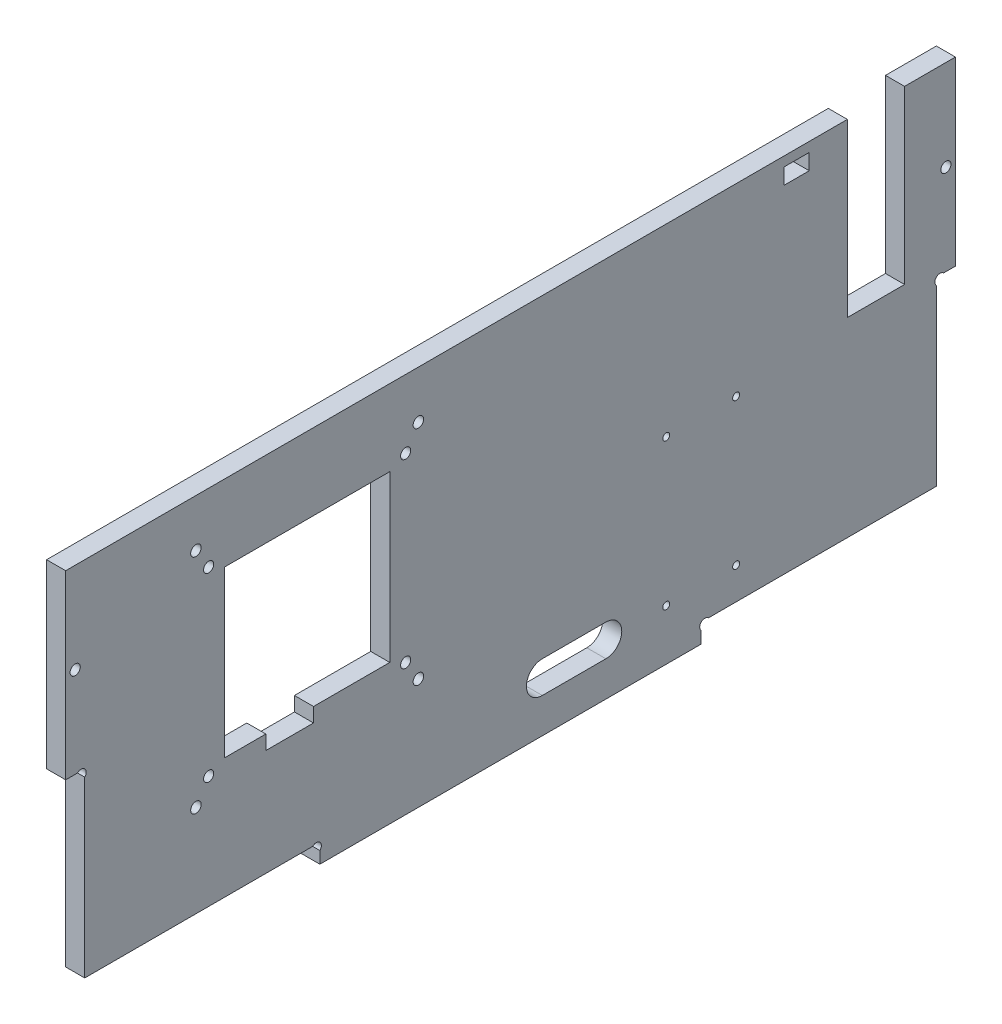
from build123d import *

# Parameters (mm, degrees)
ESQUISSE1_R             = 1.6
ESQUISSE1_R_2           = 1.65
ESQUISSE1_R_3           = 1.1
ESQUISSE1_W             = 8
ESQUISSE1_H             = 5
BOSS_EXTRU_1_DEPTH      = 6
ESQUISSE2_R             = 1.1
ENL_V_MAT_EXTRU_1_DEPTH = 1


with BuildPart() as part:
    # Esquisse1 → Boss.-Extru.1 (new body)
    with BuildSketch(Plane(origin=(0, 0, 0), x_dir=(0, 0, -1), z_dir=(1, 0, 0))):
        with BuildLine():
            Line((-60, 3.7372583), (-60, 0))
            Line((-60, 0), (60, 0))
            Line((60, 0), (60, 3.7372583))
            ThreePointArc((60, 3.7372583), (60, 6), (62.2627417, 6))
            Line((62.2627417, 6), (134, 6))
            Line((134, 6), (134, 60.7372583))
            ThreePointArc((134, 60.7372583), (134, 63), (136.2627417, 63))
            Line((136.2627417, 63), (140, 63))
            Line((140, 63), (140, 120))
            Line((140, 120), (124, 120))
            Line((124, 120), (124, 66))
            Line((124, 66), (106, 66))
            Line((106, 66), (106, 120))
            Line((106, 120), (-140, 120))
            Line((-140, 120), (-140, 63))
            Line((-140, 63), (-136.2627417, 63))
            ThreePointArc((-136.2627417, 63), (-134, 63), (-134, 60.7372583))
            Line((-134, 60.7372583), (-134, 6))
            Line((-134, 6), (-62.2627417, 6))
            ThreePointArc((-62.2627417, 6), (-60, 6), (-60, 3.7372583))
        make_face()
        with Locations((137, 91.5)):
            Circle(ESQUISSE1_R, mode=Mode.SUBTRACT)
        with Locations(Location((-137, 91.5, 0), (0, 0, 180))):
            Circle(ESQUISSE1_R, mode=Mode.SUBTRACT)
        with Locations(Location((-99, 105, 0), (0, 0, 180))):
            Circle(ESQUISSE1_R_2, mode=Mode.SUBTRACT)
        with Locations((-29, 105)):
            Circle(ESQUISSE1_R_2, mode=Mode.SUBTRACT)
        with Locations(Location((-29, 35, 0), (0, 0, 180))):
            Circle(ESQUISSE1_R_2, mode=Mode.SUBTRACT)
        with Locations((-99, 35)):
            Circle(ESQUISSE1_R_2, mode=Mode.SUBTRACT)
        with Locations((-95, 98.5)):
            Circle(ESQUISSE1_R, mode=Mode.SUBTRACT)
        with Locations(Location((-33, 98.5, 0), (0, 0, 180))):
            Circle(ESQUISSE1_R, mode=Mode.SUBTRACT)
        with Locations((-33, 41.5)):
            Circle(ESQUISSE1_R, mode=Mode.SUBTRACT)
        with Locations(Location((-95, 41.5, 0), (0, 0, 180))):
            Circle(ESQUISSE1_R, mode=Mode.SUBTRACT)
        with Locations((49, 62)):
            Circle(ESQUISSE1_R_3, mode=Mode.SUBTRACT)
        with Locations((49, 16)):
            Circle(ESQUISSE1_R_3, mode=Mode.SUBTRACT)
        with Locations(Location((71, 16, 0), (0, 0, 180))):
            Circle(ESQUISSE1_R_3, mode=Mode.SUBTRACT)
        with Locations(Location((71, 62, 0), (0, 0, 180))):
            Circle(ESQUISSE1_R_3, mode=Mode.SUBTRACT)
        Polygon((-38, 96), (-90, 96), (-90, 44), (-77, 44), (-77, 39.5), (-62, 39.5), (-62, 44), (-38, 44), align=None, mode=Mode.SUBTRACT)
        with BuildLine():
            Line((30, 21), (10, 21))
            ThreePointArc((10, 21), (5, 16), (10, 11))
            Line((10, 11), (30, 11))
            ThreePointArc((30, 11), (35, 16), (30, 21))
        make_face(mode=Mode.SUBTRACT)
        with Locations((90, 114.5)):
            Rectangle(ESQUISSE1_W, ESQUISSE1_H, mode=Mode.SUBTRACT)
    extrude(amount=BOSS_EXTRU_1_DEPTH)

    # Esquisse2 → Enl_v. mat.-Extru.1 (cut)
    with BuildSketch(Plane.ZY):
        with Locations((-36, 75)):
            Circle(ESQUISSE2_R)
        with Locations(Location((10, 75, 0), (0, 0, 180))):
            Circle(ESQUISSE2_R)
        with Locations((10, 53)):
            Circle(ESQUISSE2_R)
        with Locations(Location((-36, 53, 0), (0, 0, 180))):
            Circle(ESQUISSE2_R)
    extrude(amount=-ENL_V_MAT_EXTRU_1_DEPTH, mode=Mode.SUBTRACT)


solid = part.part
